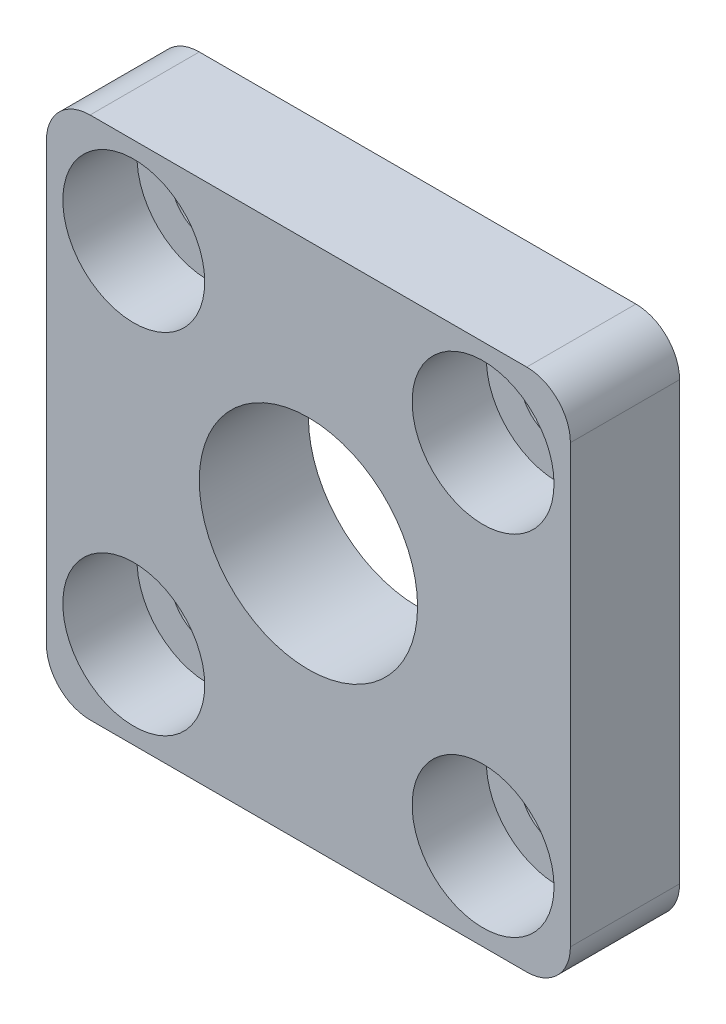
from build123d import *

# Parameters (mm, degrees)
SKIZZE1_W                                            = 24
SKIZZE1_H                                            = 24
SKIZZE1_R                                            = 5
AUFSATZ_LINEAR_AUSTRAGEN1_DEPTH                      = 5
STIRNSENKUNG_F_R_M3_ZYLINDERSCHRAUBE_MIT_D           = 3.4
STIRNSENKUNG_F_R_M3_ZYLINDERSCHRAUBE_MIT_CBORE_D     = 6.5
STIRNSENKUNG_F_R_M3_ZYLINDERSCHRAUBE_MIT_CBORE_DEPTH = 3.4
VERRUNDUNG1_R                                        = 2


with BuildPart() as part:
    # Skizze1 → Aufsatz-Linear austragen1 (new body)
    with BuildSketch(Plane.XY):
        Rectangle(SKIZZE1_W, SKIZZE1_H)
        Circle(SKIZZE1_R, mode=Mode.SUBTRACT)
    extrude(amount=AUFSATZ_LINEAR_AUSTRAGEN1_DEPTH)

    # Stirnsenkung f_r M3 Zylinderschraube mit (through all)
    with Locations(Plane.XY.offset(5)):
        with Locations((-8, 8), (8, 8), (8, -8), (-8, -8)):
            CounterBoreHole(STIRNSENKUNG_F_R_M3_ZYLINDERSCHRAUBE_MIT_D / 2, STIRNSENKUNG_F_R_M3_ZYLINDERSCHRAUBE_MIT_CBORE_D / 2, STIRNSENKUNG_F_R_M3_ZYLINDERSCHRAUBE_MIT_CBORE_DEPTH)

    # Verrundung1
    verrundung1_edges = [part.edges().sort_by_distance(p)[0] for p in [
        (12, -12, 2.5),
        (-12, -12, 2.5),
        (-12, 12, 2.5),
        (12, 12, 2.5),
    ]]
    fillet(verrundung1_edges, radius=VERRUNDUNG1_R)


solid = part.part
